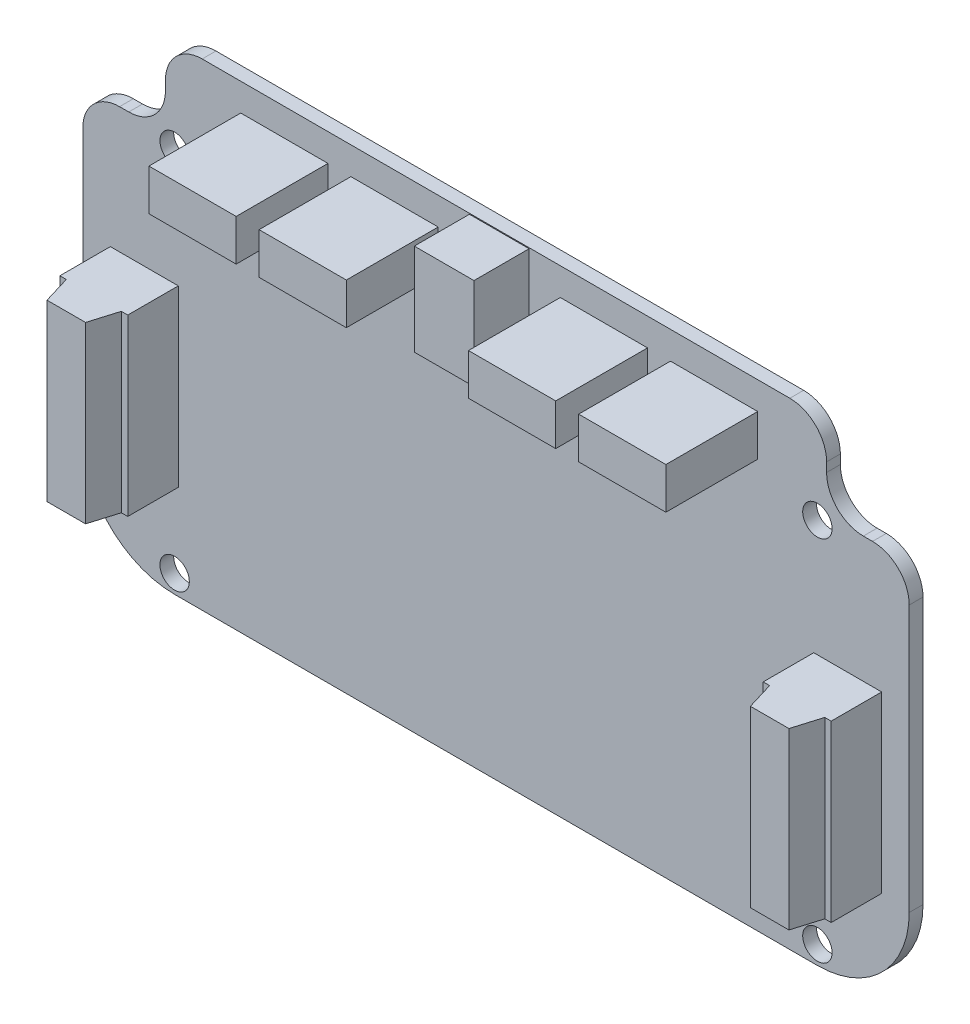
from build123d import *

# Parameters (mm, degrees)
BOSS_EXTRU_1_DEPTH              = 1.5
DIAM_TRE_DU_PER_AGE_3_2_3_2_1_D = 3.2
ESQUISSE5_W                     = 9.5
ESQUISSE5_H                     = 4.5
BOSS_EXTRU_2_DEPTH              = 10
ESQUISSE6_W                     = 6.5
ESQUISSE6_H                     = 10
BOSS_EXTRU_3_DEPTH              = 6
BOSS_EXTRU_4_DEPTH              = 19


with BuildPart() as part:
    # Esquisse1 → Boss.-Extru.1 (new body)
    with BuildSketch(Plane.XY):
        with BuildLine():
            Line((-10, 0), (-80, 0))
            ThreePointArc((-80, 0), (-87.071067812, 2.928932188), (-90, 10))
            Line((-90, 10), (-90, 39))
            ThreePointArc((-90, 39), (-88.828427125, 41.828427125), (-86, 43))
            Line((-86, 43), (-85, 43))
            ThreePointArc((-85, 43), (-82.171572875, 44.171572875), (-81, 47))
            Line((-81, 47), (-81, 48))
            ThreePointArc((-81, 48), (-79.828427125, 50.828427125), (-77, 52))
            Line((-77, 52), (-13, 52))
            ThreePointArc((-13, 52), (-10.171572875, 50.828427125), (-9, 48))
            Line((-9, 48), (-9, 47))
            ThreePointArc((-9, 47), (-7.828427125, 44.171572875), (-5, 43))
            Line((-5, 43), (-4, 43))
            ThreePointArc((-4, 43), (-1.171572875, 41.828427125), (0, 39))
            Line((0, 39), (0, 10))
            ThreePointArc((0, 10), (-2.928932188, 2.928932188), (-10, 0))
        make_face()
    extrude(amount=BOSS_EXTRU_1_DEPTH)

    # Diam_tre du per_age _3.2 _3.2_1 (through all)
    with Locations(Plane.XY.offset(1.5)):
        with Locations((-80, 42), (-10, 42), (-10, 2), (-80, 2)):
            Hole(DIAM_TRE_DU_PER_AGE_3_2_3_2_1_D / 2)

    # Esquisse5 → Boss.-Extru.2 (add)
    with BuildSketch(Plane.XY.offset(1.5)):
        with Locations((-68.05, 46.75)):
            Rectangle(ESQUISSE5_W, ESQUISSE5_H)
        with Locations((-21.25, 46.75)):
            Rectangle(ESQUISSE5_W, ESQUISSE5_H)
        with Locations((-56.05, 46.75)):
            Rectangle(ESQUISSE5_W, ESQUISSE5_H)
        with Locations((-33.25, 46.75)):
            Rectangle(ESQUISSE5_W, ESQUISSE5_H)
    extrude(amount=BOSS_EXTRU_2_DEPTH)

    # Esquisse6 → Boss.-Extru.3 (add)
    with BuildSketch(Plane.XY.offset(1.5)):
        with Locations((-44.65, 46.9)):
            Rectangle(ESQUISSE6_W, ESQUISSE6_H)
    extrude(amount=BOSS_EXTRU_3_DEPTH)

    # Esquisse8 → Boss.-Extru.4 (add)
    with BuildSketch(Plane(origin=(0, 10.3, 0), x_dir=(-1, 0, 0), z_dir=(0, -1, 0))):
        Polygon((87, -1.5), (79.6, -1.5), (79.6, -7), (80.3, -7), (81.2, -10), (85.4, -10), (86.3, -7), (87, -7), align=None)
        Polygon((3.7, -7), (3, -7), (3, -1.5), (10.4, -1.5), (10.4, -7), (9.7, -7), (8.8, -10), (4.6, -10), align=None)
    extrude(amount=-BOSS_EXTRU_4_DEPTH)


solid = part.part
